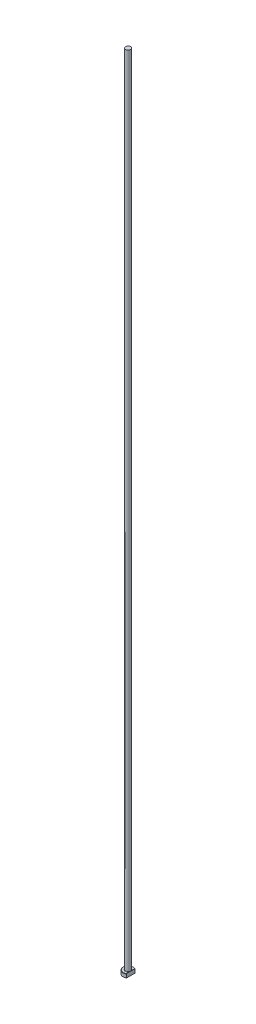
ISO-10303-21;
HEADER;
FILE_DESCRIPTION(('STEP AP214'),'2;1');
FILE_NAME('part.step','',(''),(''),'','','');
FILE_SCHEMA(('AUTOMOTIVE_DESIGN { 1 0 10303 214 1 1 1 1 }'));
ENDSEC;
DATA;
#1=APPLICATION_CONTEXT('core data for automotive mechanical design processes');
#2=APPLICATION_PROTOCOL_DEFINITION('international standard','automotive_design',2000,#1);
#3=PRODUCT_CONTEXT('',#1,'mechanical');
#4=PRODUCT('Part','Part','',(#3));
#5=PRODUCT_RELATED_PRODUCT_CATEGORY('part','',(#4));
#6=PRODUCT_DEFINITION_FORMATION('','',#4);
#7=PRODUCT_DEFINITION_CONTEXT('part definition',#1,'design');
#8=PRODUCT_DEFINITION('design','',#6,#7);
#9=PRODUCT_DEFINITION_SHAPE('','',#8);
#10=(LENGTH_UNIT() NAMED_UNIT(*) SI_UNIT(.MILLI.,.METRE.));
#11=(NAMED_UNIT(*) PLANE_ANGLE_UNIT() SI_UNIT($,.RADIAN.));
#12=(NAMED_UNIT(*) SI_UNIT($,.STERADIAN.) SOLID_ANGLE_UNIT());
#13=UNCERTAINTY_MEASURE_WITH_UNIT(LENGTH_MEASURE(1.E-05),#10,'distance_accuracy_value','');
#14=(GEOMETRIC_REPRESENTATION_CONTEXT(3) GLOBAL_UNCERTAINTY_ASSIGNED_CONTEXT((#13)) GLOBAL_UNIT_ASSIGNED_CONTEXT((#10,
#11,#12)) REPRESENTATION_CONTEXT('',''));
#15=CARTESIAN_POINT('',(0.,0.,0.));
#16=DIRECTION('',(0.,0.,1.));
#17=DIRECTION('',(1.,0.,0.));
#18=AXIS2_PLACEMENT_3D('',#15,#16,#17);
#19=CARTESIAN_POINT('',(0.,0.,0.));
#20=DIRECTION('',(0.,-1.,0.));
#21=DIRECTION('',(0.,0.,-1.));
#22=AXIS2_PLACEMENT_3D('',#19,#20,#21);
#23=PLANE('',#22);
#24=CARTESIAN_POINT('',(0.,0.,0.));
#25=DIRECTION('',(0.,-1.,0.));
#26=DIRECTION('',(0.,0.,-1.));
#27=AXIS2_PLACEMENT_3D('',#24,#25,#26);
#28=CIRCLE('',#27,3.79999999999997);
#29=CARTESIAN_POINT('',(1.99999999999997,0.,3.23109888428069));
#30=VERTEX_POINT('',#29);
#31=CARTESIAN_POINT('',(1.99999999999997,0.,-3.23109888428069));
#32=VERTEX_POINT('',#31);
#33=EDGE_CURVE('E98',#30,#32,#28,.T.);
#34=ORIENTED_EDGE('',*,*,#33,.T.);
#35=DIRECTION('',(0.,0.,1.));
#36=VECTOR('',#35,1.);
#37=CARTESIAN_POINT('',(1.99999999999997,0.,-3.46410161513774));
#38=LINE('',#37,#36);
#39=EDGE_CURVE('E83',#32,#30,#38,.T.);
#40=ORIENTED_EDGE('',*,*,#39,.T.);
#41=EDGE_LOOP('',(#34,#40));
#42=FACE_BOUND('',#41,.T.);
#43=ADVANCED_FACE('F32',(#42),#23,.T.);
#44=CARTESIAN_POINT('',(0.,259.958771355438,0.));
#45=DIRECTION('',(0.,1.,0.));
#46=DIRECTION('',(0.,0.,1.));
#47=AXIS2_PLACEMENT_3D('',#44,#45,#46);
#48=CYLINDRICAL_SURFACE('',#47,3.99999999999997);
#49=CARTESIAN_POINT('',(0.,2.80000000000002,0.));
#50=DIRECTION('',(0.,1.,0.));
#51=DIRECTION('',(0.,0.,1.));
#52=AXIS2_PLACEMENT_3D('',#49,#50,#51);
#53=CIRCLE('',#52,3.99999999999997);
#54=CARTESIAN_POINT('',(1.99999999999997,2.80000000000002,3.46410161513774));
#55=VERTEX_POINT('',#54);
#56=CARTESIAN_POINT('',(1.99999999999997,2.80000000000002,-3.46410161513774));
#57=VERTEX_POINT('',#56);
#58=EDGE_CURVE('E104',#55,#57,#53,.F.);
#59=ORIENTED_EDGE('',*,*,#58,.T.);
#60=DIRECTION('',(0.,-1.,0.));
#61=VECTOR('',#60,1.);
#62=CARTESIAN_POINT('',(1.99999999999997,630.,-3.46410161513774));
#63=LINE('',#62,#61);
#64=CARTESIAN_POINT('',(1.99999999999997,0.200000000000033,-3.46410161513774));
#65=VERTEX_POINT('',#64);
#66=EDGE_CURVE('E183',#57,#65,#63,.T.);
#67=ORIENTED_EDGE('',*,*,#66,.T.);
#68=CARTESIAN_POINT('',(0.,0.200000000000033,0.));
#69=DIRECTION('',(0.,-1.,0.));
#70=DIRECTION('',(0.,0.,-1.));
#71=AXIS2_PLACEMENT_3D('',#68,#69,#70);
#72=CIRCLE('',#71,3.99999999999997);
#73=CARTESIAN_POINT('',(1.99999999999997,0.200000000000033,3.46410161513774));
#74=VERTEX_POINT('',#73);
#75=EDGE_CURVE('E100',#65,#74,#72,.F.);
#76=ORIENTED_EDGE('',*,*,#75,.T.);
#77=DIRECTION('',(0.,-1.,0.));
#78=VECTOR('',#77,1.);
#79=CARTESIAN_POINT('',(1.99999999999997,630.,3.46410161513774));
#80=LINE('',#79,#78);
#81=EDGE_CURVE('E93',#55,#74,#80,.T.);
#82=ORIENTED_EDGE('',*,*,#81,.F.);
#83=EDGE_LOOP('',(#59,#67,#76,#82));
#84=FACE_BOUND('',#83,.T.);
#85=ADVANCED_FACE('F158',(#84),#48,.T.);
#86=CARTESIAN_POINT('',(-3.99999999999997,3.,0.));
#87=DIRECTION('',(0.,1.,0.));
#88=DIRECTION('',(0.,0.,1.));
#89=AXIS2_PLACEMENT_3D('',#86,#87,#88);
#90=PLANE('',#89);
#91=CARTESIAN_POINT('',(0.,3.,0.));
#92=DIRECTION('',(0.,1.,0.));
#93=DIRECTION('',(0.,0.,1.));
#94=AXIS2_PLACEMENT_3D('',#91,#92,#93);
#95=CIRCLE('',#94,3.80000000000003);
#96=CARTESIAN_POINT('',(1.99999999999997,3.,-3.23109888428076));
#97=VERTEX_POINT('',#96);
#98=CARTESIAN_POINT('',(1.99999999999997,3.,3.23109888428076));
#99=VERTEX_POINT('',#98);
#100=EDGE_CURVE('E178',#97,#99,#95,.T.);
#101=ORIENTED_EDGE('',*,*,#100,.T.);
#102=DIRECTION('',(0.,0.,-1.));
#103=VECTOR('',#102,1.);
#104=CARTESIAN_POINT('',(1.99999999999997,3.,0.));
#105=LINE('',#104,#103);
#106=CARTESIAN_POINT('',(1.99999999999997,2.99999999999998,0.916515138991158));
#107=VERTEX_POINT('',#106);
#108=EDGE_CURVE('E57',#99,#107,#105,.T.);
#109=ORIENTED_EDGE('',*,*,#108,.T.);
#110=CARTESIAN_POINT('',(0.,3.,0.));
#111=DIRECTION('',(0.,1.,0.));
#112=DIRECTION('',(0.,0.,1.));
#113=AXIS2_PLACEMENT_3D('',#110,#111,#112);
#114=CIRCLE('',#113,2.19999999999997);
#115=CARTESIAN_POINT('',(1.99999999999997,2.99999999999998,-0.9165151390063));
#116=VERTEX_POINT('',#115);
#117=EDGE_CURVE('E107',#107,#116,#114,.F.);
#118=ORIENTED_EDGE('',*,*,#117,.T.);
#119=EDGE_CURVE('E136',#116,#97,#105,.T.);
#120=ORIENTED_EDGE('',*,*,#119,.T.);
#121=EDGE_LOOP('',(#101,#109,#118,#120));
#122=FACE_BOUND('',#121,.T.);
#123=ADVANCED_FACE('F147',(#122),#90,.T.);
#124=CARTESIAN_POINT('',(0.,3.,0.));
#125=DIRECTION('',(0.,-1.,0.));
#126=DIRECTION('',(0.,0.,-1.));
#127=AXIS2_PLACEMENT_3D('',#124,#125,#126);
#128=CONICAL_SURFACE('',#127,3.80000000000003,0.785398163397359);
#129=ORIENTED_EDGE('',*,*,#58,.F.);
#130=CARTESIAN_POINT('',(1.99999999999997,-1.08095467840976,7.62295524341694));
#131=CARTESIAN_POINT('',(1.99999999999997,-0.913887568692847,7.4502239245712));
#132=CARTESIAN_POINT('',(1.99999999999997,-0.746999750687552,7.27731861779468));
#133=CARTESIAN_POINT('',(1.99999999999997,-0.41368874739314,6.93105655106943));
#134=CARTESIAN_POINT('',(1.99999999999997,-0.247265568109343,6.75769978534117));
#135=CARTESIAN_POINT('',(1.99999999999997,0.08509080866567,6.41034692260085));
#136=CARTESIAN_POINT('',(1.99999999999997,0.251023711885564,6.23635054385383));
#137=CARTESIAN_POINT('',(1.99999999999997,0.582155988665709,5.88766284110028));
#138=CARTESIAN_POINT('',(1.99999999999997,0.747355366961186,5.71297152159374));
#139=CARTESIAN_POINT('',(1.99999999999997,1.0735385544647,5.36616839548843));
#140=CARTESIAN_POINT('',(1.99999999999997,1.23454099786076,5.19407412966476));
#141=CARTESIAN_POINT('',(1.99999999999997,1.55534102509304,4.8487666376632));
#142=CARTESIAN_POINT('',(1.99999999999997,1.71513861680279,4.67555341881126));
#143=CARTESIAN_POINT('',(1.99999999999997,2.0330618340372,4.3276656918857));
#144=CARTESIAN_POINT('',(1.99999999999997,2.19118781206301,4.15299150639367));
#145=CARTESIAN_POINT('',(1.99999999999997,2.50513944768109,3.80159134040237));
#146=CARTESIAN_POINT('',(1.99999999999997,2.66096519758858,3.62486544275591));
#147=CARTESIAN_POINT('',(1.99999999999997,2.90974646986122,3.33722425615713));
#148=CARTESIAN_POINT('',(1.99999999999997,3.00376148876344,3.22722645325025));
#149=CARTESIAN_POINT('',(1.99999999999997,3.19011825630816,3.00579987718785));
#150=CARTESIAN_POINT('',(1.99999999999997,3.28245983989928,2.89437096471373));
#151=CARTESIAN_POINT('',(1.99999999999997,3.46586188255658,2.66849662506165));
#152=CARTESIAN_POINT('',(1.99999999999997,3.55689849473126,2.55403176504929));
#153=CARTESIAN_POINT('',(1.99999999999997,3.73578809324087,2.32266819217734));
#154=CARTESIAN_POINT('',(1.99999999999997,3.82364184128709,2.20577007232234));
#155=CARTESIAN_POINT('',(1.99999999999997,3.99612756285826,1.96688707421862));
#156=CARTESIAN_POINT('',(1.99999999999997,4.08069035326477,1.84485190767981));
#157=CARTESIAN_POINT('',(1.99999999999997,4.24300264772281,1.59599329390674));
#158=CARTESIAN_POINT('',(1.99999999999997,4.32074277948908,1.46916359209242));
#159=CARTESIAN_POINT('',(1.99999999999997,4.42869763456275,1.27510066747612));
#160=CARTESIAN_POINT('',(1.99999999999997,4.46305374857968,1.2101894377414));
#161=CARTESIAN_POINT('',(1.99999999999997,4.52837146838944,1.07868835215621));
#162=CARTESIAN_POINT('',(1.99999999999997,4.55933245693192,1.01209819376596));
#163=CARTESIAN_POINT('',(1.99999999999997,4.6456686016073,0.80989435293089));
#164=CARTESIAN_POINT('',(1.99999999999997,4.69478214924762,0.671360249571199));
#165=CARTESIAN_POINT('',(1.99999999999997,4.74794829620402,0.463657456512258));
#166=CARTESIAN_POINT('',(1.99999999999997,4.76205065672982,0.397033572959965));
#167=CARTESIAN_POINT('',(1.99999999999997,4.78390371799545,0.262728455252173));
#168=CARTESIAN_POINT('',(1.99999999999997,4.79165498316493,0.195047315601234));
#169=CARTESIAN_POINT('',(1.99999999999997,4.80025690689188,0.0594528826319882));
#170=CARTESIAN_POINT('',(1.99999999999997,4.80112894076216,-0.00845903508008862));
#171=CARTESIAN_POINT('',(1.99999999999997,4.79596585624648,-0.144020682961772));
#172=CARTESIAN_POINT('',(1.99999999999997,4.78993016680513,-0.211670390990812));
#173=CARTESIAN_POINT('',(1.99999999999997,4.77145363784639,-0.345483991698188));
#174=CARTESIAN_POINT('',(1.99999999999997,4.75906777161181,-0.41165563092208));
#175=CARTESIAN_POINT('',(1.99999999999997,4.72866360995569,-0.542678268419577));
#176=CARTESIAN_POINT('',(1.99999999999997,4.71064463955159,-0.607529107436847));
#177=CARTESIAN_POINT('',(1.99999999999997,4.66972939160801,-0.736064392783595));
#178=CARTESIAN_POINT('',(1.99999999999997,4.64680564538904,-0.799739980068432));
#179=CARTESIAN_POINT('',(1.99999999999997,4.59700147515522,-0.925489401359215));
#180=CARTESIAN_POINT('',(1.99999999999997,4.57012185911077,-0.98756355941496));
#181=CARTESIAN_POINT('',(1.99999999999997,4.48443518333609,-1.17209020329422));
#182=CARTESIAN_POINT('',(1.99999999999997,4.42077407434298,-1.29228210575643));
#183=CARTESIAN_POINT('',(1.99999999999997,4.28502644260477,-1.52785770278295));
#184=CARTESIAN_POINT('',(1.99999999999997,4.21292931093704,-1.6432350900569));
#185=CARTESIAN_POINT('',(1.99999999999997,4.0628151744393,-1.87069387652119));
#186=CARTESIAN_POINT('',(1.99999999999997,3.98477595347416,-1.98276048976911));
#187=CARTESIAN_POINT('',(1.99999999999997,3.8248197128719,-2.20397837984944));
#188=CARTESIAN_POINT('',(1.99999999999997,3.74290465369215,-2.31313108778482));
#189=CARTESIAN_POINT('',(1.99999999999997,3.57517222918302,-2.53068545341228));
#190=CARTESIAN_POINT('',(1.99999999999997,3.48931769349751,-2.63905831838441));
#191=CARTESIAN_POINT('',(1.99999999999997,3.3154815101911,-2.85409686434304));
#192=CARTESIAN_POINT('',(1.99999999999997,3.22749963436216,-2.96076236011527));
#193=CARTESIAN_POINT('',(1.99999999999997,3.05015030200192,-3.17249211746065));
#194=CARTESIAN_POINT('',(1.99999999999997,2.96078672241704,-3.27755963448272));
#195=CARTESIAN_POINT('',(1.99999999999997,2.78082366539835,-3.48663191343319));
#196=CARTESIAN_POINT('',(1.99999999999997,2.69022416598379,-3.59063665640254));
#197=CARTESIAN_POINT('',(1.99999999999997,2.44796733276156,-3.86612439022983));
#198=CARTESIAN_POINT('',(1.99999999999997,2.29545972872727,-4.0368591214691));
#199=CARTESIAN_POINT('',(1.99999999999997,1.98858070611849,-4.37664803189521));
#200=CARTESIAN_POINT('',(1.99999999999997,1.83420923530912,-4.54570216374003));
#201=CARTESIAN_POINT('',(1.99999999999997,1.52396102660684,-4.88271638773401));
#202=CARTESIAN_POINT('',(1.99999999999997,1.36808300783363,-5.05067529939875));
#203=CARTESIAN_POINT('',(1.99999999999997,1.05530513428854,-5.38563883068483));
#204=CARTESIAN_POINT('',(1.99999999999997,0.898405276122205,-5.55264344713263));
#205=CARTESIAN_POINT('',(1.99999999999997,0.590290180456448,-5.87905385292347));
#206=CARTESIAN_POINT('',(1.99999999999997,0.439106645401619,-6.03848959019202));
#207=CARTESIAN_POINT('',(1.99999999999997,0.136164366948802,-6.3568145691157));
#208=CARTESIAN_POINT('',(1.99999999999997,-0.0155943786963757,-6.51570380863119));
#209=CARTESIAN_POINT('',(1.99999999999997,-0.319404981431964,-6.83286192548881));
#210=CARTESIAN_POINT('',(1.99999999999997,-0.471456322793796,-6.99113129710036));
#211=CARTESIAN_POINT('',(1.99999999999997,-0.775939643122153,-7.30730102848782));
#212=CARTESIAN_POINT('',(1.99999999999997,-0.928371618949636,-7.46520139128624));
#213=CARTESIAN_POINT('',(1.99999999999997,-1.08095467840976,-7.62295524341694));
#214=B_SPLINE_CURVE_WITH_KNOTS('',3,(#130,#131,#132,#133,#134,#135,#136,#137,#138,#139,#140,
#141,#142,#143,#144,#145,#146,#147,#148,#149,#150,#151,#152,#153,#154,#155,#156,#157,#158,#159,
#160,#161,#162,#163,#164,#165,#166,#167,#168,#169,#170,#171,#172,#173,#174,#175,#176,#177,#178,
#179,#180,#181,#182,#183,#184,#185,#186,#187,#188,#189,#190,#191,#192,#193,#194,#195,#196,#197,
#198,#199,#200,#201,#202,#203,#204,#205,#206,#207,#208,#209,#210,#211,#212,#213),.UNSPECIFIED.,
.F.,.F.,(4,2,2,2,2,2,2,2,2,2,2,2,2,2,2,2,2,2,2,2,2,2,2,2,2,2,2,2,2,2,2,2,2,2,2,2,2,2,2,2,2,4),
(0.,0.720921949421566,1.44185317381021,2.16315326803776,2.88444869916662,3.59144103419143,
4.29842874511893,5.00526427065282,5.71207135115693,6.14616174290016,6.58029471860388,
7.01901494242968,7.45762947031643,7.90290456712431,8.34878206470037,8.56901415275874,
8.78928621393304,9.22814472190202,9.43219512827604,9.63622739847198,9.83962544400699,
10.0430403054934,10.244723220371,10.4464303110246,10.6492980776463,10.8521244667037,
11.2595582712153,11.6675100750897,12.0770700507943,12.4864250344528,12.9011677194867,
13.3159550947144,13.7297367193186,14.1435257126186,14.8302935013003,15.5170805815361,
16.2045145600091,16.891950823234,17.5511045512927,18.2102608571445,18.8686819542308,
19.5270976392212),.UNSPECIFIED.);
#215=EDGE_CURVE('E135',#55,#99,#214,.T.);
#216=ORIENTED_EDGE('',*,*,#215,.T.);
#217=ORIENTED_EDGE('',*,*,#100,.F.);
#218=EDGE_CURVE('E127',#97,#57,#214,.T.);
#219=ORIENTED_EDGE('',*,*,#218,.T.);
#220=EDGE_LOOP('',(#129,#216,#217,#219));
#221=FACE_BOUND('',#220,.T.);
#222=ADVANCED_FACE('F143',(#221),#128,.T.);
#223=CARTESIAN_POINT('',(0.,0.200000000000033,0.));
#224=DIRECTION('',(0.,1.,0.));
#225=DIRECTION('',(0.,0.,1.));
#226=AXIS2_PLACEMENT_3D('',#223,#224,#225);
#227=CONICAL_SURFACE('',#226,3.99999999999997,0.785398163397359);
#228=ORIENTED_EDGE('',*,*,#75,.F.);
#229=CARTESIAN_POINT('',(1.99999999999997,4.08095467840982,-7.62295524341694));
#230=CARTESIAN_POINT('',(1.99999999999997,3.9138875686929,-7.4502239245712));
#231=CARTESIAN_POINT('',(1.99999999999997,3.74699975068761,-7.27731861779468));
#232=CARTESIAN_POINT('',(1.99999999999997,3.4136887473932,-6.93105655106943));
#233=CARTESIAN_POINT('',(1.99999999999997,3.2472655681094,-6.75769978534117));
#234=CARTESIAN_POINT('',(1.99999999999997,2.91490919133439,-6.41034692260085));
#235=CARTESIAN_POINT('',(1.99999999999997,2.74897628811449,-6.23635054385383));
#236=CARTESIAN_POINT('',(1.99999999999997,2.41784401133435,-5.88766284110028));
#237=CARTESIAN_POINT('',(1.99999999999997,2.25264463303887,-5.71297152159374));
#238=CARTESIAN_POINT('',(1.99999999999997,1.92646144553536,-5.36616839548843));
#239=CARTESIAN_POINT('',(1.99999999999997,1.7654590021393,-5.19407412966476));
#240=CARTESIAN_POINT('',(1.99999999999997,1.44465897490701,-4.8487666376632));
#241=CARTESIAN_POINT('',(1.99999999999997,1.28486138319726,-4.67555341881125));
#242=CARTESIAN_POINT('',(1.99999999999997,0.966938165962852,-4.3276656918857));
#243=CARTESIAN_POINT('',(1.99999999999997,0.808812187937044,-4.15299150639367));
#244=CARTESIAN_POINT('',(1.99999999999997,0.494860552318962,-3.80159134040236));
#245=CARTESIAN_POINT('',(1.99999999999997,0.339034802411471,-3.62486544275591));
#246=CARTESIAN_POINT('',(1.99999999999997,0.0902535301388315,-3.33722425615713));
#247=CARTESIAN_POINT('',(1.99999999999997,-0.00376148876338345,-3.22722645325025));
#248=CARTESIAN_POINT('',(1.99999999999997,-0.190118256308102,-3.00579987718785));
#249=CARTESIAN_POINT('',(1.99999999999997,-0.282459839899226,-2.89437096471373));
#250=CARTESIAN_POINT('',(1.99999999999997,-0.465861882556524,-2.66849662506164));
#251=CARTESIAN_POINT('',(1.99999999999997,-0.556898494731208,-2.55403176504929));
#252=CARTESIAN_POINT('',(1.99999999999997,-0.735788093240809,-2.32266819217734));
#253=CARTESIAN_POINT('',(1.99999999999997,-0.82364184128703,-2.20577007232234));
#254=CARTESIAN_POINT('',(1.99999999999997,-0.996127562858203,-1.96688707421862));
#255=CARTESIAN_POINT('',(1.99999999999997,-1.08069035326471,-1.84485190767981));
#256=CARTESIAN_POINT('',(1.99999999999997,-1.24300264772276,-1.59599329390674));
#257=CARTESIAN_POINT('',(1.99999999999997,-1.32074277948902,-1.46916359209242));
#258=CARTESIAN_POINT('',(1.99999999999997,-1.42869763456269,-1.27510066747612));
#259=CARTESIAN_POINT('',(1.99999999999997,-1.46305374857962,-1.2101894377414));
#260=CARTESIAN_POINT('',(1.99999999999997,-1.52837146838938,-1.07868835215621));
#261=CARTESIAN_POINT('',(1.99999999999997,-1.55933245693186,-1.01209819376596));
#262=CARTESIAN_POINT('',(1.99999999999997,-1.64566860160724,-0.80989435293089));
#263=CARTESIAN_POINT('',(1.99999999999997,-1.69478214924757,-0.671360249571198));
#264=CARTESIAN_POINT('',(1.99999999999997,-1.74794829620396,-0.463657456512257));
#265=CARTESIAN_POINT('',(1.99999999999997,-1.76205065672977,-0.397033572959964));
#266=CARTESIAN_POINT('',(1.99999999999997,-1.78390371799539,-0.262728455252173));
#267=CARTESIAN_POINT('',(1.99999999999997,-1.79165498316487,-0.195047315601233));
#268=CARTESIAN_POINT('',(1.99999999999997,-1.80025690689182,-0.0594528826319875));
#269=CARTESIAN_POINT('',(1.99999999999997,-1.8011289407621,0.00845903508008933));
#270=CARTESIAN_POINT('',(1.99999999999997,-1.79596585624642,0.144020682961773));
#271=CARTESIAN_POINT('',(1.99999999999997,-1.78993016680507,0.211670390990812));
#272=CARTESIAN_POINT('',(1.99999999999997,-1.77145363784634,0.345483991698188));
#273=CARTESIAN_POINT('',(1.99999999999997,-1.75906777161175,0.411655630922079));
#274=CARTESIAN_POINT('',(1.99999999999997,-1.72866360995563,0.542678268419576));
#275=CARTESIAN_POINT('',(1.99999999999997,-1.71064463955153,0.607529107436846));
#276=CARTESIAN_POINT('',(1.99999999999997,-1.66972939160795,0.736064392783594));
#277=CARTESIAN_POINT('',(1.99999999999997,-1.64680564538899,0.799739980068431));
#278=CARTESIAN_POINT('',(1.99999999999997,-1.59700147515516,0.925489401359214));
#279=CARTESIAN_POINT('',(1.99999999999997,-1.57012185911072,0.987563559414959));
#280=CARTESIAN_POINT('',(1.99999999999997,-1.48443518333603,1.17209020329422));
#281=CARTESIAN_POINT('',(1.99999999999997,-1.42077407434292,1.29228210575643));
#282=CARTESIAN_POINT('',(1.99999999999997,-1.28502644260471,1.52785770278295));
#283=CARTESIAN_POINT('',(1.99999999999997,-1.21292931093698,1.6432350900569));
#284=CARTESIAN_POINT('',(1.99999999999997,-1.06281517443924,1.87069387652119));
#285=CARTESIAN_POINT('',(1.99999999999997,-0.984775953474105,1.98276048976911));
#286=CARTESIAN_POINT('',(1.99999999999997,-0.824819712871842,2.20397837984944));
#287=CARTESIAN_POINT('',(1.99999999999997,-0.742904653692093,2.31313108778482));
#288=CARTESIAN_POINT('',(1.99999999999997,-0.575172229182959,2.53068545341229));
#289=CARTESIAN_POINT('',(1.99999999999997,-0.489317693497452,2.63905831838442));
#290=CARTESIAN_POINT('',(1.99999999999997,-0.315481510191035,2.85409686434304));
#291=CARTESIAN_POINT('',(1.99999999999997,-0.227499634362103,2.96076236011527));
#292=CARTESIAN_POINT('',(1.99999999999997,-0.0501503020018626,3.17249211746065));
#293=CARTESIAN_POINT('',(1.99999999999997,0.0392132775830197,3.27755963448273));
#294=CARTESIAN_POINT('',(1.99999999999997,0.219176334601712,3.48663191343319));
#295=CARTESIAN_POINT('',(1.99999999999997,0.309775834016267,3.59063665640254));
#296=CARTESIAN_POINT('',(1.99999999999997,0.552032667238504,3.86612439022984));
#297=CARTESIAN_POINT('',(1.99999999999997,0.70454027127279,4.0368591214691));
#298=CARTESIAN_POINT('',(1.99999999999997,1.01141929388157,4.37664803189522));
#299=CARTESIAN_POINT('',(1.99999999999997,1.16579076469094,4.54570216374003));
#300=CARTESIAN_POINT('',(1.99999999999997,1.47603897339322,4.88271638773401));
#301=CARTESIAN_POINT('',(1.99999999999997,1.63191699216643,5.05067529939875));
#302=CARTESIAN_POINT('',(1.99999999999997,1.94469486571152,5.38563883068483));
#303=CARTESIAN_POINT('',(1.99999999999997,2.10159472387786,5.55264344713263));
#304=CARTESIAN_POINT('',(1.99999999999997,2.40970981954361,5.87905385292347));
#305=CARTESIAN_POINT('',(1.99999999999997,2.56089335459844,6.03848959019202));
#306=CARTESIAN_POINT('',(1.99999999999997,2.86383563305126,6.35681456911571));
#307=CARTESIAN_POINT('',(1.99999999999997,3.01559437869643,6.51570380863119));
#308=CARTESIAN_POINT('',(1.99999999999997,3.31940498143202,6.83286192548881));
#309=CARTESIAN_POINT('',(1.99999999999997,3.47145632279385,6.99113129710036));
#310=CARTESIAN_POINT('',(1.99999999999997,3.77593964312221,7.30730102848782));
#311=CARTESIAN_POINT('',(1.99999999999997,3.92837161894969,7.46520139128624));
#312=CARTESIAN_POINT('',(1.99999999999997,4.08095467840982,7.62295524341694));
#313=B_SPLINE_CURVE_WITH_KNOTS('',3,(#229,#230,#231,#232,#233,#234,#235,#236,#237,#238,#239,
#240,#241,#242,#243,#244,#245,#246,#247,#248,#249,#250,#251,#252,#253,#254,#255,#256,#257,#258,
#259,#260,#261,#262,#263,#264,#265,#266,#267,#268,#269,#270,#271,#272,#273,#274,#275,#276,#277,
#278,#279,#280,#281,#282,#283,#284,#285,#286,#287,#288,#289,#290,#291,#292,#293,#294,#295,#296,
#297,#298,#299,#300,#301,#302,#303,#304,#305,#306,#307,#308,#309,#310,#311,#312),.UNSPECIFIED.,
.F.,.F.,(4,2,2,2,2,2,2,2,2,2,2,2,2,2,2,2,2,2,2,2,2,2,2,2,2,2,2,2,2,2,2,2,2,2,2,2,2,2,2,2,2,4),
(0.,0.720921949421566,1.4418531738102,2.16315326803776,2.88444869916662,3.59144103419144,
4.29842874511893,5.00526427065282,5.71207135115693,6.14616174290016,6.58029471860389,
7.01901494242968,7.45762947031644,7.90290456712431,8.34878206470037,8.56901415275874,
8.78928621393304,9.22814472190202,9.43219512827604,9.63622739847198,9.83962544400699,
10.0430403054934,10.244723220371,10.4464303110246,10.6492980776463,10.8521244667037,
11.2595582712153,11.6675100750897,12.0770700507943,12.4864250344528,12.9011677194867,
13.3159550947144,13.7297367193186,14.1435257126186,14.8302935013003,15.5170805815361,
16.2045145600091,16.891950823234,17.5511045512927,18.2102608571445,18.8686819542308,
19.5270976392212),.UNSPECIFIED.);
#314=EDGE_CURVE('E86',#65,#32,#313,.T.);
#315=ORIENTED_EDGE('',*,*,#314,.T.);
#316=ORIENTED_EDGE('',*,*,#33,.F.);
#317=EDGE_CURVE('E89',#30,#74,#313,.T.);
#318=ORIENTED_EDGE('',*,*,#317,.T.);
#319=EDGE_LOOP('',(#228,#315,#316,#318));
#320=FACE_BOUND('',#319,.T.);
#321=ADVANCED_FACE('F97',(#320),#227,.T.);
#322=CARTESIAN_POINT('',(0.,3.19999999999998,0.));
#323=DIRECTION('',(0.,1.,0.));
#324=DIRECTION('',(0.,0.,1.));
#325=AXIS2_PLACEMENT_3D('',#322,#323,#324);
#326=TOROIDAL_SURFACE('',#325,2.19999999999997,0.2);
#327=CARTESIAN_POINT('',(1.99999999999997,3.19999999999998,0.));
#328=CARTESIAN_POINT('',(1.99999999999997,3.20000050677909,1.13930257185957E-10));
#329=CARTESIAN_POINT('',(1.99999999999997,3.20000101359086,-1.46766790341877E-07));
#330=CARTESIAN_POINT('',(1.99999999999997,3.20000197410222,-5.82067439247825E-07));
#331=CARTESIAN_POINT('',(1.99999999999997,3.20000242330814,-8.77873003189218E-07));
#332=CARTESIAN_POINT('',(1.99999999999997,3.20000333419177,-1.58424512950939E-06));
#333=CARTESIAN_POINT('',(1.99999999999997,3.20000378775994,-2.00534281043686E-06));
#334=CARTESIAN_POINT('',(1.99999999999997,3.20000462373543,-2.89558838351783E-06));
#335=CARTESIAN_POINT('',(1.99999999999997,3.20000500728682,-3.3637232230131E-06));
#336=CARTESIAN_POINT('',(1.99999999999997,3.20000636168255,-5.10887545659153E-06));
#337=CARTESIAN_POINT('',(1.99999999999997,3.2000072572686,-6.44597273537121E-06));
#338=CARTESIAN_POINT('',(1.99999999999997,3.20000879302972,-9.14926709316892E-06));
#339=CARTESIAN_POINT('',(1.99999999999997,3.20000944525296,-1.05089714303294E-05));
#340=CARTESIAN_POINT('',(1.99999999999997,3.20001204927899,-1.60555879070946E-05));
#341=CARTESIAN_POINT('',(1.99999999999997,3.20001390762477,-2.02908746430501E-05));
#342=CARTESIAN_POINT('',(1.99999999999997,3.20001676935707,-2.84438492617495E-05));
#343=CARTESIAN_POINT('',(1.99999999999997,3.2000178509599,-3.23343257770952E-05));
#344=CARTESIAN_POINT('',(1.99999999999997,3.20002551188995,-6.06027142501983E-05));
#345=CARTESIAN_POINT('',(1.99999999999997,3.20003111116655,-8.51991843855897E-05));
#346=CARTESIAN_POINT('',(1.99999999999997,3.20005559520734,-0.000181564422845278));
#347=CARTESIAN_POINT('',(1.99999999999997,3.20007914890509,-0.00025209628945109));
#348=CARTESIAN_POINT('',(1.99999999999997,3.20017002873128,-0.000529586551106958));
#349=CARTESIAN_POINT('',(1.99999999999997,3.20023415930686,-0.000737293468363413));
#350=CARTESIAN_POINT('',(1.99999999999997,3.20048926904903,-0.00155657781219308));
#351=CARTESIAN_POINT('',(1.99999999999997,3.20068414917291,-0.00216722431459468));
#352=CARTESIAN_POINT('',(1.99999999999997,3.20148805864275,-0.00469384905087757));
#353=CARTESIAN_POINT('',(1.99999999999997,3.20209226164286,-0.00661098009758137));
#354=CARTESIAN_POINT('',(1.99999999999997,3.20822779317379,-0.026069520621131));
#355=CARTESIAN_POINT('',(1.99999999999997,3.21378174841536,-0.0436057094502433));
#356=CARTESIAN_POINT('',(1.99999999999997,3.22462834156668,-0.0780127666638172));
#357=CARTESIAN_POINT('',(1.99999999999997,3.2299227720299,-0.0948831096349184));
#358=CARTESIAN_POINT('',(1.99999999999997,3.24110477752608,-0.130713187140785));
#359=CARTESIAN_POINT('',(1.99999999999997,3.24698536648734,-0.149675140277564));
#360=CARTESIAN_POINT('',(1.99999999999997,3.2586983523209,-0.187834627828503));
#361=CARTESIAN_POINT('',(1.99999999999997,3.26452957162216,-0.207032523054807));
#362=CARTESIAN_POINT('',(1.99999999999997,3.27861584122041,-0.254071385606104));
#363=CARTESIAN_POINT('',(1.99999999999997,3.28678835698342,-0.281937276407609));
#364=CARTESIAN_POINT('',(1.99999999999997,3.30249503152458,-0.337115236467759));
#365=CARTESIAN_POINT('',(1.99999999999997,3.31003989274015,-0.36442425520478));
#366=CARTESIAN_POINT('',(1.99999999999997,3.32554795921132,-0.422841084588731));
#367=CARTESIAN_POINT('',(1.99999999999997,3.33343288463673,-0.453970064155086));
#368=CARTESIAN_POINT('',(1.99999999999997,3.34833120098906,-0.516667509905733));
#369=CARTESIAN_POINT('',(1.99999999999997,3.3553379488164,-0.548237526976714));
#370=CARTESIAN_POINT('',(1.99999999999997,3.37554978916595,-0.647984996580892));
#371=CARTESIAN_POINT('',(1.99999999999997,3.38665117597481,-0.716635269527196));
#372=CARTESIAN_POINT('',(1.99999999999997,3.39785773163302,-0.832445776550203));
#373=CARTESIAN_POINT('',(1.99999999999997,3.40036304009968,-0.879345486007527));
#374=CARTESIAN_POINT('',(1.99999999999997,3.3997602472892,-0.94923898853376));
#375=CARTESIAN_POINT('',(1.99999999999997,3.39886048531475,-0.972248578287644));
#376=CARTESIAN_POINT('',(1.99999999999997,3.39534463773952,-1.01812773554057));
#377=CARTESIAN_POINT('',(1.99999999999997,3.39273014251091,-1.04099741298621));
#378=CARTESIAN_POINT('',(1.99999999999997,3.38623968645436,-1.08102660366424));
#379=CARTESIAN_POINT('',(1.99999999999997,3.38280841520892,-1.09825717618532));
#380=CARTESIAN_POINT('',(1.99999999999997,3.37442567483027,-1.13243508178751));
#381=CARTESIAN_POINT('',(1.99999999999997,3.36946777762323,-1.14938089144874));
#382=CARTESIAN_POINT('',(1.99999999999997,3.35764172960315,-1.18276398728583));
#383=CARTESIAN_POINT('',(1.99999999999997,3.3507581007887,-1.19919590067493));
#384=CARTESIAN_POINT('',(1.99999999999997,3.33462082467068,-1.23083581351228));
#385=CARTESIAN_POINT('',(1.99999999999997,3.32537783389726,-1.24604892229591));
#386=CARTESIAN_POINT('',(1.99999999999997,3.30929159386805,-1.26715296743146));
#387=CARTESIAN_POINT('',(1.99999999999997,3.30356769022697,-1.27389441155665));
#388=CARTESIAN_POINT('',(1.99999999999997,3.29128925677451,-1.28659894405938));
#389=CARTESIAN_POINT('',(1.99999999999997,3.28473413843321,-1.2925614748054));
#390=CARTESIAN_POINT('',(1.99999999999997,3.27066594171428,-1.30346436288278));
#391=CARTESIAN_POINT('',(1.99999999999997,3.26314132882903,-1.30839014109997));
#392=CARTESIAN_POINT('',(1.99999999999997,3.24727957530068,-1.31668687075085));
#393=CARTESIAN_POINT('',(1.99999999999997,3.23894498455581,-1.32006252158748));
#394=CARTESIAN_POINT('',(1.99999999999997,3.22424089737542,-1.3241557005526));
#395=CARTESIAN_POINT('',(1.99999999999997,3.21800630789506,-1.32536112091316));
#396=CARTESIAN_POINT('',(1.99999999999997,3.20542266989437,-1.32669615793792));
#397=CARTESIAN_POINT('',(1.99999999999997,3.19907368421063,-1.32682634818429));
#398=CARTESIAN_POINT('',(1.99999999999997,3.18645152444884,-1.32599950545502));
#399=CARTESIAN_POINT('',(1.99999999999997,3.18017831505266,-1.32504300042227));
#400=CARTESIAN_POINT('',(1.99999999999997,3.16787181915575,-1.32212308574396));
#401=CARTESIAN_POINT('',(1.99999999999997,3.16183869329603,-1.3201590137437));
#402=CARTESIAN_POINT('',(1.99999999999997,3.14844260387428,-1.3146656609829));
#403=CARTESIAN_POINT('',(1.99999999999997,3.14119825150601,-1.31084826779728));
#404=CARTESIAN_POINT('',(1.99999999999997,3.12742328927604,-1.30209252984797));
#405=CARTESIAN_POINT('',(1.99999999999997,3.12089414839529,-1.2971519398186));
#406=CARTESIAN_POINT('',(1.99999999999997,3.10554761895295,-1.28382084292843));
#407=CARTESIAN_POINT('',(1.99999999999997,3.09717242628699,-1.27492468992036));
#408=CARTESIAN_POINT('',(1.99999999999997,3.08188323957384,-1.25597903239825));
#409=CARTESIAN_POINT('',(1.99999999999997,3.07497120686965,-1.24592800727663));
#410=CARTESIAN_POINT('',(1.99999999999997,3.05771073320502,-1.21734573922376));
#411=CARTESIAN_POINT('',(1.99999999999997,3.04862251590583,-1.19806017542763));
#412=CARTESIAN_POINT('',(1.99999999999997,3.03323781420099,-1.15830155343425));
#413=CARTESIAN_POINT('',(1.99999999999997,3.02696471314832,-1.13782009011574));
#414=CARTESIAN_POINT('',(1.99999999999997,3.0165915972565,-1.09607450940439));
#415=CARTESIAN_POINT('',(1.99999999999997,3.0125177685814,-1.07480405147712));
#416=CARTESIAN_POINT('',(1.99999999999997,3.00618909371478,-1.03196822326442));
#417=CARTESIAN_POINT('',(1.99999999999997,3.00393768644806,-1.01040237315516));
#418=CARTESIAN_POINT('',(1.99999999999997,2.99950887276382,-0.94694819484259));
#419=CARTESIAN_POINT('',(1.99999999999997,2.99937097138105,-0.904921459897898));
#420=CARTESIAN_POINT('',(1.99999999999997,3.00391139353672,-0.800067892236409));
#421=CARTESIAN_POINT('',(1.99999999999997,3.01103947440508,-0.7373784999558));
#422=CARTESIAN_POINT('',(1.99999999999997,3.0310998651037,-0.611444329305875));
#423=CARTESIAN_POINT('',(1.99999999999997,3.04417074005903,-0.548223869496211));
#424=CARTESIAN_POINT('',(1.99999999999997,3.06920011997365,-0.442888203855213));
#425=CARTESIAN_POINT('',(1.99999999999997,3.08016343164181,-0.40052705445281));
#426=CARTESIAN_POINT('',(1.99999999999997,3.10315303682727,-0.316588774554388));
#427=CARTESIAN_POINT('',(1.99999999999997,3.11516655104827,-0.275008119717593));
#428=CARTESIAN_POINT('',(1.99999999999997,3.13853403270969,-0.196672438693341));
#429=CARTESIAN_POINT('',(1.99999999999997,3.14981294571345,-0.159894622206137));
#430=CARTESIAN_POINT('',(1.99999999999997,3.17316886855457,-0.0849211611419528));
#431=CARTESIAN_POINT('',(1.99999999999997,3.1852595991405,-0.0467297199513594));
#432=CARTESIAN_POINT('',(1.99999999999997,3.19790869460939,-0.00660765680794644));
#433=CARTESIAN_POINT('',(1.99999999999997,3.19851400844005,-0.00468723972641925));
#434=CARTESIAN_POINT('',(1.99999999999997,3.19931818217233,-0.00215985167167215));
#435=CARTESIAN_POINT('',(1.99999999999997,3.19951225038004,-0.00155173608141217));
#436=CARTESIAN_POINT('',(1.99999999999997,3.19976637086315,-0.000735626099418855));
#437=CARTESIAN_POINT('',(1.99999999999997,3.19983030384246,-0.000528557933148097));
#438=CARTESIAN_POINT('',(1.99999999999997,3.1999209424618,-0.000251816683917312));
#439=CARTESIAN_POINT('',(1.99999999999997,3.19994446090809,-0.000181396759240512));
#440=CARTESIAN_POINT('',(1.99999999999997,3.19996891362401,-8.51622335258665E-05));
#441=CARTESIAN_POINT('',(1.99999999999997,3.19997450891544,-6.05824642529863E-05));
#442=CARTESIAN_POINT('',(1.99999999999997,3.19998216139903,-3.23308900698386E-05));
#443=CARTESIAN_POINT('',(1.99999999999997,3.19998324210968,-2.8441435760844E-05));
#444=CARTESIAN_POINT('',(1.99999999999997,3.19998610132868,-2.02904708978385E-05));
#445=CARTESIAN_POINT('',(1.99999999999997,3.19998795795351,-1.60561197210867E-05));
#446=CARTESIAN_POINT('',(1.99999999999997,3.19999055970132,-1.05104410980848E-05));
#447=CARTESIAN_POINT('',(1.99999999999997,3.19999121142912,-9.15081310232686E-06));
#448=CARTESIAN_POINT('',(1.99999999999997,3.19999274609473,-6.44758190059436E-06));
#449=CARTESIAN_POINT('',(1.99999999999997,3.19999364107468,-5.11046368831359E-06));
#450=CARTESIAN_POINT('',(1.99999999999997,3.19999499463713,-3.36517633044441E-06));
#451=CARTESIAN_POINT('',(1.99999999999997,3.19999537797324,-2.89697952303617E-06));
#452=CARTESIAN_POINT('',(1.99999999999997,3.19999621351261,-2.00657123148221E-06));
#453=CARTESIAN_POINT('',(1.99999999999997,3.19999666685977,-1.58537194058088E-06));
#454=CARTESIAN_POINT('',(1.99999999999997,3.19999757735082,-8.78757202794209E-07));
#455=CARTESIAN_POINT('',(1.99999999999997,3.19999802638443,-5.82817881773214E-07));
#456=CARTESIAN_POINT('',(1.99999999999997,3.19999898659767,-1.47186730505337E-07));
#457=CARTESIAN_POINT('',(1.99999999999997,3.1999994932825,-1.13916400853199E-10));
#458=CARTESIAN_POINT('',(1.99999999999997,3.19999999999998,0.));
#459=B_SPLINE_CURVE_WITH_KNOTS('',3,(#327,#328,#329,#330,#331,#332,#333,#334,#335,#336,#337,
#338,#339,#340,#341,#342,#343,#344,#345,#346,#347,#348,#349,#350,#351,#352,#353,#354,#355,#356,
#357,#358,#359,#360,#361,#362,#363,#364,#365,#366,#367,#368,#369,#370,#371,#372,#373,#374,#375,
#376,#377,#378,#379,#380,#381,#382,#383,#384,#385,#386,#387,#388,#389,#390,#391,#392,#393,#394,
#395,#396,#397,#398,#399,#400,#401,#402,#403,#404,#405,#406,#407,#408,#409,#410,#411,#412,#413,
#414,#415,#416,#417,#418,#419,#420,#421,#422,#423,#424,#425,#426,#427,#428,#429,#430,#431,#432,
#433,#434,#435,#436,#437,#438,#439,#440,#441,#442,#443,#444,#445,#446,#447,#448,#449,#450,#451,
#452,#453,#454,#455,#456,#457,#458),.UNSPECIFIED.,.T.,.F.,(4,2,2,2,2,2,2,2,2,2,2,2,2,2,2,2,2,2,
2,2,2,2,2,2,2,2,2,2,2,2,2,2,2,2,2,2,2,2,2,2,2,2,2,2,2,2,2,2,2,2,2,2,2,2,2,2,2,2,2,2,2,2,2,2,2,
4),(0.,1.5236988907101E-06,3.13175187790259E-06,4.97933886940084E-06,6.79332734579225E-06,
1.1600592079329E-05,1.61211192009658E-05,2.99630987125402E-05,4.20611843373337E-05,
0.000117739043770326,0.000340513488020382,0.000992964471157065,0.00291555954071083,
0.00894623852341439,0.0641278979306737,0.117173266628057,0.176731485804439,0.236923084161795,
0.324038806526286,0.409031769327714,0.50535329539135,0.602364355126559,0.810598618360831,
0.951214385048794,1.0202479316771,1.08921754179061,1.14187257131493,1.19475241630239,
1.24807013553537,1.30115116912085,1.32762610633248,1.35411989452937,1.38096446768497,
1.40772711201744,1.42669285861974,1.44564848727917,1.46459491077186,1.48355380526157,
1.50798338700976,1.5324622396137,1.56891061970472,1.60540755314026,1.66900939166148,
1.73313017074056,1.79799846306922,1.86298887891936,1.98877684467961,2.17764082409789,
2.37115413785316,2.50240556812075,2.632237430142,2.74764208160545,2.86781494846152,
2.87385601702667,2.87577064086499,2.87642108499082,2.87664350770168,2.87671913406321,
2.87673122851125,2.87674506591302,2.87674958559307,2.87675439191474,2.87675620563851,
2.87675805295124,2.87675966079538,2.87676118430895),.UNSPECIFIED.);
#460=CARTESIAN_POINT('',(1.99999999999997,3.19999999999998,0.));
#461=VERTEX_POINT('',#460);
#462=EDGE_CURVE('E11',#116,#461,#459,.T.);
#463=ORIENTED_EDGE('',*,*,#462,.F.);
#464=ORIENTED_EDGE('',*,*,#117,.F.);
#465=CARTESIAN_POINT('',(1.99999999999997,3.19999999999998,0.));
#466=CARTESIAN_POINT('',(1.99999999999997,3.19999949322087,-1.13930327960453E-10));
#467=CARTESIAN_POINT('',(1.99999999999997,3.1999989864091,1.46766790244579E-07));
#468=CARTESIAN_POINT('',(1.99999999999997,3.19999802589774,5.82067439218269E-07));
#469=CARTESIAN_POINT('',(1.99999999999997,3.19999757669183,8.77873003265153E-07));
#470=CARTESIAN_POINT('',(1.99999999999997,3.19999666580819,1.58424512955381E-06));
#471=CARTESIAN_POINT('',(1.99999999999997,3.19999621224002,2.00534281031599E-06));
#472=CARTESIAN_POINT('',(1.99999999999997,3.19999537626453,2.89558838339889E-06));
#473=CARTESIAN_POINT('',(1.99999999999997,3.19999499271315,3.36372322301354E-06));
#474=CARTESIAN_POINT('',(1.99999999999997,3.19999363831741,5.10887545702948E-06));
#475=CARTESIAN_POINT('',(1.99999999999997,3.19999274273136,6.44597273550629E-06));
#476=CARTESIAN_POINT('',(1.99999999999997,3.19999120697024,9.14926709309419E-06));
#477=CARTESIAN_POINT('',(1.99999999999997,3.199990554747,1.05089714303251E-05));
#478=CARTESIAN_POINT('',(1.99999999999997,3.19998795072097,1.60555879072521E-05));
#479=CARTESIAN_POINT('',(1.99999999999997,3.1999860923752,2.02908746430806E-05));
#480=CARTESIAN_POINT('',(1.99999999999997,3.19998323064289,2.84438492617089E-05));
#481=CARTESIAN_POINT('',(1.99999999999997,3.19998214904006,3.23343257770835E-05));
#482=CARTESIAN_POINT('',(1.99999999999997,3.19997448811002,6.06027142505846E-05));
#483=CARTESIAN_POINT('',(1.99999999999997,3.19996888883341,8.51991843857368E-05));
#484=CARTESIAN_POINT('',(1.99999999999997,3.19994440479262,0.000181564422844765));
#485=CARTESIAN_POINT('',(1.99999999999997,3.19992085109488,0.000252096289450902));
#486=CARTESIAN_POINT('',(1.99999999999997,3.19982997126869,0.000529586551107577));
#487=CARTESIAN_POINT('',(1.99999999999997,3.1997658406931,0.000737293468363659));
#488=CARTESIAN_POINT('',(1.99999999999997,3.19951073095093,0.00155657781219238));
#489=CARTESIAN_POINT('',(1.99999999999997,3.19931585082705,0.0021672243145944));
#490=CARTESIAN_POINT('',(1.99999999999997,3.19851194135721,0.00469384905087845));
#491=CARTESIAN_POINT('',(1.99999999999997,3.1979077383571,0.00661098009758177));
#492=CARTESIAN_POINT('',(1.99999999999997,3.19177220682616,0.0260695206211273));
#493=CARTESIAN_POINT('',(1.99999999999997,3.1862182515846,0.0436057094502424));
#494=CARTESIAN_POINT('',(1.99999999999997,3.17537165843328,0.0780127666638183));
#495=CARTESIAN_POINT('',(1.99999999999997,3.17007722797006,0.0948831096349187));
#496=CARTESIAN_POINT('',(1.99999999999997,3.15889522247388,0.130713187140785));
#497=CARTESIAN_POINT('',(1.99999999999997,3.15301463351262,0.149675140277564));
#498=CARTESIAN_POINT('',(1.99999999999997,3.14130164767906,0.187834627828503));
#499=CARTESIAN_POINT('',(1.99999999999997,3.1354704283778,0.207032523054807));
#500=CARTESIAN_POINT('',(1.99999999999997,3.12138415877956,0.254071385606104));
#501=CARTESIAN_POINT('',(1.99999999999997,3.11321164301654,0.281937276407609));
#502=CARTESIAN_POINT('',(1.99999999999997,3.09750496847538,0.337115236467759));
#503=CARTESIAN_POINT('',(1.99999999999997,3.08996010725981,0.36442425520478));
#504=CARTESIAN_POINT('',(1.99999999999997,3.07445204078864,0.422841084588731));
#505=CARTESIAN_POINT('',(1.99999999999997,3.06656711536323,0.453970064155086));
#506=CARTESIAN_POINT('',(1.99999999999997,3.0516687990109,0.516667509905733));
#507=CARTESIAN_POINT('',(1.99999999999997,3.04466205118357,0.548237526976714));
#508=CARTESIAN_POINT('',(1.99999999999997,3.02445021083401,0.647984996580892));
#509=CARTESIAN_POINT('',(1.99999999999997,3.01334882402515,0.716635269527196));
#510=CARTESIAN_POINT('',(1.99999999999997,3.00214226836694,0.832445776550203));
#511=CARTESIAN_POINT('',(1.99999999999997,2.99963695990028,0.879345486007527));
#512=CARTESIAN_POINT('',(1.99999999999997,3.00023975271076,0.94923898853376));
#513=CARTESIAN_POINT('',(1.99999999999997,3.00113951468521,0.972248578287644));
#514=CARTESIAN_POINT('',(1.99999999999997,3.00465536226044,1.01812773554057));
#515=CARTESIAN_POINT('',(1.99999999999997,3.00726985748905,1.04099741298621));
#516=CARTESIAN_POINT('',(1.99999999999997,3.0137603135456,1.08102660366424));
#517=CARTESIAN_POINT('',(1.99999999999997,3.01719158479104,1.09825717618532));
#518=CARTESIAN_POINT('',(1.99999999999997,3.02557432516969,1.13243508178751));
#519=CARTESIAN_POINT('',(1.99999999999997,3.03053222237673,1.14938089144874));
#520=CARTESIAN_POINT('',(1.99999999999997,3.04235827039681,1.18276398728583));
#521=CARTESIAN_POINT('',(1.99999999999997,3.04924189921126,1.19919590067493));
#522=CARTESIAN_POINT('',(1.99999999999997,3.06537917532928,1.23083581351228));
#523=CARTESIAN_POINT('',(1.99999999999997,3.0746221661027,1.24604892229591));
#524=CARTESIAN_POINT('',(1.99999999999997,3.09070840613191,1.26715296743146));
#525=CARTESIAN_POINT('',(1.99999999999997,3.09643230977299,1.27389441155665));
#526=CARTESIAN_POINT('',(1.99999999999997,3.10871074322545,1.28659894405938));
#527=CARTESIAN_POINT('',(1.99999999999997,3.11526586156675,1.2925614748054));
#528=CARTESIAN_POINT('',(1.99999999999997,3.12933405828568,1.30346436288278));
#529=CARTESIAN_POINT('',(1.99999999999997,3.13685867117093,1.30839014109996));
#530=CARTESIAN_POINT('',(1.99999999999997,3.15272042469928,1.31668687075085));
#531=CARTESIAN_POINT('',(1.99999999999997,3.16105501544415,1.32006252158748));
#532=CARTESIAN_POINT('',(1.99999999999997,3.17575910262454,1.3241557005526));
#533=CARTESIAN_POINT('',(1.99999999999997,3.1819936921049,1.32536112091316));
#534=CARTESIAN_POINT('',(1.99999999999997,3.1945773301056,1.32669615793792));
#535=CARTESIAN_POINT('',(1.99999999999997,3.20092631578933,1.32682634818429));
#536=CARTESIAN_POINT('',(1.99999999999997,3.21354847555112,1.32599950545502));
#537=CARTESIAN_POINT('',(1.99999999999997,3.2198216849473,1.32504300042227));
#538=CARTESIAN_POINT('',(1.99999999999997,3.23212818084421,1.32212308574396));
#539=CARTESIAN_POINT('',(1.99999999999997,3.23816130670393,1.3201590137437));
#540=CARTESIAN_POINT('',(1.99999999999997,3.25155739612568,1.3146656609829));
#541=CARTESIAN_POINT('',(1.99999999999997,3.25880174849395,1.31084826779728));
#542=CARTESIAN_POINT('',(1.99999999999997,3.27257671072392,1.30209252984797));
#543=CARTESIAN_POINT('',(1.99999999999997,3.27910585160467,1.2971519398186));
#544=CARTESIAN_POINT('',(1.99999999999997,3.29445238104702,1.28382084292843));
#545=CARTESIAN_POINT('',(1.99999999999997,3.30282757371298,1.27492468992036));
#546=CARTESIAN_POINT('',(1.99999999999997,3.31811676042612,1.25597903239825));
#547=CARTESIAN_POINT('',(1.99999999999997,3.32502879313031,1.24592800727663));
#548=CARTESIAN_POINT('',(1.99999999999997,3.34228926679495,1.21734573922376));
#549=CARTESIAN_POINT('',(1.99999999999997,3.35137748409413,1.19806017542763));
#550=CARTESIAN_POINT('',(1.99999999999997,3.36676218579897,1.15830155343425));
#551=CARTESIAN_POINT('',(1.99999999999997,3.37303528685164,1.13782009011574));
#552=CARTESIAN_POINT('',(1.99999999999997,3.38340840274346,1.09607450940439));
#553=CARTESIAN_POINT('',(1.99999999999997,3.38748223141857,1.07480405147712));
#554=CARTESIAN_POINT('',(1.99999999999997,3.39381090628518,1.03196822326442));
#555=CARTESIAN_POINT('',(1.99999999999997,3.3960623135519,1.01040237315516));
#556=CARTESIAN_POINT('',(1.99999999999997,3.40049112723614,0.94694819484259));
#557=CARTESIAN_POINT('',(1.99999999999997,3.40062902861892,0.904921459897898));
#558=CARTESIAN_POINT('',(1.99999999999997,3.39608860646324,0.800067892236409));
#559=CARTESIAN_POINT('',(1.99999999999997,3.38896052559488,0.7373784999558));
#560=CARTESIAN_POINT('',(1.99999999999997,3.36890013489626,0.611444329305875));
#561=CARTESIAN_POINT('',(1.99999999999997,3.35582925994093,0.548223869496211));
#562=CARTESIAN_POINT('',(1.99999999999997,3.33079988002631,0.442888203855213));
#563=CARTESIAN_POINT('',(1.99999999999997,3.31983656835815,0.40052705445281));
#564=CARTESIAN_POINT('',(1.99999999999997,3.29684696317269,0.316588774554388));
#565=CARTESIAN_POINT('',(1.99999999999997,3.28483344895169,0.275008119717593));
#566=CARTESIAN_POINT('',(1.99999999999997,3.26146596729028,0.196672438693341));
#567=CARTESIAN_POINT('',(1.99999999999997,3.25018705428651,0.159894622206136));
#568=CARTESIAN_POINT('',(1.99999999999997,3.22683113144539,0.0849211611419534));
#569=CARTESIAN_POINT('',(1.99999999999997,3.21474040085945,0.0467297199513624));
#570=CARTESIAN_POINT('',(1.99999999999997,3.20209130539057,0.00660765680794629));
#571=CARTESIAN_POINT('',(1.99999999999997,3.20148599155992,0.00468723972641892));
#572=CARTESIAN_POINT('',(1.99999999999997,3.20068181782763,0.00215985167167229));
#573=CARTESIAN_POINT('',(1.99999999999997,3.20048774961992,0.0015517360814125));
#574=CARTESIAN_POINT('',(1.99999999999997,3.20023362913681,0.000735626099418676));
#575=CARTESIAN_POINT('',(1.99999999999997,3.2001696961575,0.000528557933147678));
#576=CARTESIAN_POINT('',(1.99999999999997,3.20007905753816,0.000251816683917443));
#577=CARTESIAN_POINT('',(1.99999999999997,3.20005553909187,0.000181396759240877));
#578=CARTESIAN_POINT('',(1.99999999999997,3.20003108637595,8.51622335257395E-05));
#579=CARTESIAN_POINT('',(1.99999999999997,3.20002549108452,6.05824642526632E-05));
#580=CARTESIAN_POINT('',(1.99999999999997,3.20001783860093,3.23308900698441E-05));
#581=CARTESIAN_POINT('',(1.99999999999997,3.20001675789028,2.84414357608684E-05));
#582=CARTESIAN_POINT('',(1.99999999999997,3.20001389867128,2.02904708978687E-05));
#583=CARTESIAN_POINT('',(1.99999999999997,3.20001204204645,1.6056119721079E-05));
#584=CARTESIAN_POINT('',(1.99999999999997,3.20000944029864,1.05104410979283E-05));
#585=CARTESIAN_POINT('',(1.99999999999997,3.20000878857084,9.15081310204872E-06));
#586=CARTESIAN_POINT('',(1.99999999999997,3.20000725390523,6.44758190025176E-06));
#587=CARTESIAN_POINT('',(1.99999999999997,3.20000635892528,5.1104636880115E-06));
#588=CARTESIAN_POINT('',(1.99999999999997,3.20000500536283,3.36517633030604E-06));
#589=CARTESIAN_POINT('',(1.99999999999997,3.20000462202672,2.8969795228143E-06));
#590=CARTESIAN_POINT('',(1.99999999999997,3.20000378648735,2.0065712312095E-06));
#591=CARTESIAN_POINT('',(1.99999999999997,3.20000333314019,1.58537194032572E-06));
#592=CARTESIAN_POINT('',(1.99999999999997,3.20000242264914,8.78757202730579E-07));
#593=CARTESIAN_POINT('',(1.99999999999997,3.20000197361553,5.82817881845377E-07));
#594=CARTESIAN_POINT('',(1.99999999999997,3.20000101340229,1.47186730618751E-07));
#595=CARTESIAN_POINT('',(1.99999999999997,3.20000050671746,1.13916471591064E-10));
#596=CARTESIAN_POINT('',(1.99999999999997,3.19999999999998,0.));
#597=B_SPLINE_CURVE_WITH_KNOTS('',3,(#465,#466,#467,#468,#469,#470,#471,#472,#473,#474,#475,
#476,#477,#478,#479,#480,#481,#482,#483,#484,#485,#486,#487,#488,#489,#490,#491,#492,#493,#494,
#495,#496,#497,#498,#499,#500,#501,#502,#503,#504,#505,#506,#507,#508,#509,#510,#511,#512,#513,
#514,#515,#516,#517,#518,#519,#520,#521,#522,#523,#524,#525,#526,#527,#528,#529,#530,#531,#532,
#533,#534,#535,#536,#537,#538,#539,#540,#541,#542,#543,#544,#545,#546,#547,#548,#549,#550,#551,
#552,#553,#554,#555,#556,#557,#558,#559,#560,#561,#562,#563,#564,#565,#566,#567,#568,#569,#570,
#571,#572,#573,#574,#575,#576,#577,#578,#579,#580,#581,#582,#583,#584,#585,#586,#587,#588,#589,
#590,#591,#592,#593,#594,#595,#596),.UNSPECIFIED.,.T.,.F.,(4,2,2,2,2,2,2,2,2,2,2,2,2,2,2,2,2,2,
2,2,2,2,2,2,2,2,2,2,2,2,2,2,2,2,2,2,2,2,2,2,2,2,2,2,2,2,2,2,2,2,2,2,2,2,2,2,2,2,2,2,2,2,2,2,2,
4),(0.,1.5236988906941E-06,3.13175187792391E-06,4.97933887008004E-06,6.79332734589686E-06,
1.16005920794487E-05,1.61211192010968E-05,2.99630987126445E-05,4.20611843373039E-05,
0.000117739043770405,0.00034051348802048,0.000992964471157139,0.00291555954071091,
0.00894623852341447,0.0641278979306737,0.117173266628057,0.176731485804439,0.236923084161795,
0.324038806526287,0.409031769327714,0.50535329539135,0.602364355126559,0.810598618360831,
0.951214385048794,1.0202479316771,1.08921754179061,1.14187257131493,1.19475241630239,
1.24807013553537,1.30115116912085,1.32762610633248,1.35411989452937,1.38096446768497,
1.40772711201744,1.42669285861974,1.44564848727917,1.46459491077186,1.48355380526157,
1.50798338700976,1.5324622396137,1.56891061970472,1.60540755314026,1.66900939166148,
1.73313017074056,1.79799846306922,1.86298887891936,1.98877684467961,2.17764082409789,
2.37115413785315,2.50240556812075,2.632237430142,2.74764208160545,2.86781494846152,
2.87385601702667,2.87577064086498,2.87642108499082,2.87664350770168,2.87671913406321,
2.87673122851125,2.87674506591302,2.87674958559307,2.87675439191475,2.87675620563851,
2.87675805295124,2.87675966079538,2.87676118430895),.UNSPECIFIED.);
#598=EDGE_CURVE('E46',#461,#107,#597,.T.);
#599=ORIENTED_EDGE('',*,*,#598,.F.);
#600=CARTESIAN_POINT('',(0.,3.19999999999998,0.));
#601=DIRECTION('',(0.,1.,0.));
#602=DIRECTION('',(0.,0.,1.));
#603=AXIS2_PLACEMENT_3D('',#600,#601,#602);
#604=CIRCLE('',#603,1.99999999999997);
#605=EDGE_CURVE('E103',#461,#461,#604,.T.);
#606=ORIENTED_EDGE('',*,*,#605,.F.);
#607=EDGE_LOOP('',(#463,#464,#599,#606));
#608=FACE_BOUND('',#607,.T.);
#609=ADVANCED_FACE('F34',(#608),#326,.F.);
#610=CARTESIAN_POINT('',(0.,259.958771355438,0.));
#611=DIRECTION('',(0.,1.,0.));
#612=DIRECTION('',(0.,0.,1.));
#613=AXIS2_PLACEMENT_3D('',#610,#611,#612);
#614=CYLINDRICAL_SURFACE('',#613,1.99999999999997);
#615=ORIENTED_EDGE('',*,*,#605,.T.);
#616=EDGE_LOOP('',(#615));
#617=FACE_BOUND('',#616,.T.);
#618=CARTESIAN_POINT('',(0.,630.,0.));
#619=DIRECTION('',(0.,1.,0.));
#620=DIRECTION('',(0.,0.,1.));
#621=AXIS2_PLACEMENT_3D('',#618,#619,#620);
#622=CIRCLE('',#621,1.99999999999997);
#623=CARTESIAN_POINT('',(0.,630.,1.99999999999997));
#624=VERTEX_POINT('',#623);
#625=EDGE_CURVE('E101',#624,#624,#622,.T.);
#626=ORIENTED_EDGE('',*,*,#625,.F.);
#627=EDGE_LOOP('',(#626));
#628=FACE_BOUND('',#627,.T.);
#629=ADVANCED_FACE('F155',(#617,#628),#614,.T.);
#630=CARTESIAN_POINT('',(-1.99999999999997,630.,0.));
#631=DIRECTION('',(0.,1.,0.));
#632=DIRECTION('',(0.,0.,1.));
#633=AXIS2_PLACEMENT_3D('',#630,#631,#632);
#634=PLANE('',#633);
#635=ORIENTED_EDGE('',*,*,#625,.T.);
#636=EDGE_LOOP('',(#635));
#637=FACE_BOUND('',#636,.T.);
#638=ADVANCED_FACE('F121',(#637),#634,.T.);
#639=CARTESIAN_POINT('',(1.99999999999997,630.,-3.46410161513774));
#640=DIRECTION('',(1.,0.,0.));
#641=DIRECTION('',(0.,0.,-1.));
#642=AXIS2_PLACEMENT_3D('',#639,#640,#641);
#643=PLANE('',#642);
#644=ORIENTED_EDGE('',*,*,#66,.F.);
#645=ORIENTED_EDGE('',*,*,#218,.F.);
#646=ORIENTED_EDGE('',*,*,#119,.F.);
#647=ORIENTED_EDGE('',*,*,#462,.T.);
#648=ORIENTED_EDGE('',*,*,#598,.T.);
#649=ORIENTED_EDGE('',*,*,#108,.F.);
#650=ORIENTED_EDGE('',*,*,#215,.F.);
#651=ORIENTED_EDGE('',*,*,#81,.T.);
#652=ORIENTED_EDGE('',*,*,#317,.F.);
#653=ORIENTED_EDGE('',*,*,#39,.F.);
#654=ORIENTED_EDGE('',*,*,#314,.F.);
#655=EDGE_LOOP('',(#644,#645,#646,#647,#648,#649,#650,#651,#652,#653,#654));
#656=FACE_BOUND('',#655,.T.);
#657=ADVANCED_FACE('F85',(#656),#643,.T.);
#658=CLOSED_SHELL('',(#43,#85,#123,#222,#321,#609,#629,#638,#657));
#659=MANIFOLD_SOLID_BREP('B2',#658);
#660=ADVANCED_BREP_SHAPE_REPRESENTATION('',(#18,#659),#14);
#661=SHAPE_DEFINITION_REPRESENTATION(#9,#660);
ENDSEC;
END-ISO-10303-21;
